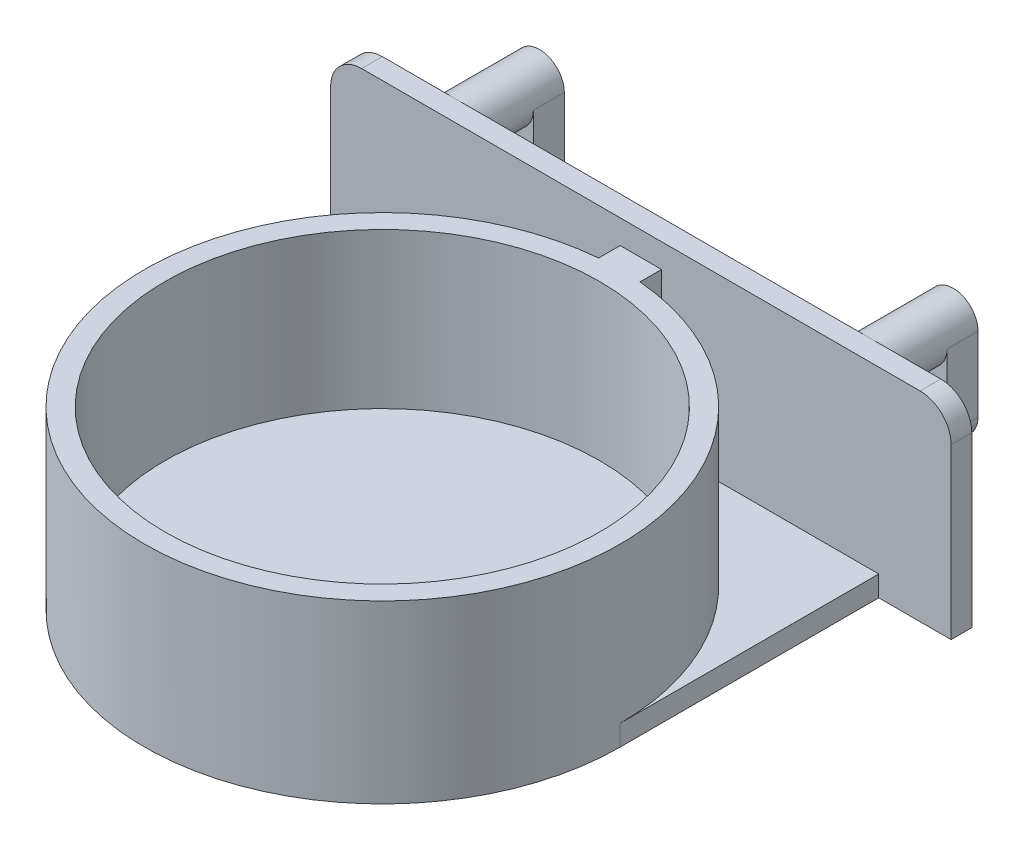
ISO-10303-21;
HEADER;
FILE_DESCRIPTION(('STEP AP214'),'2;1');
FILE_NAME('part.step','',(''),(''),'','','');
FILE_SCHEMA(('AUTOMOTIVE_DESIGN { 1 0 10303 214 1 1 1 1 }'));
ENDSEC;
DATA;
#1=APPLICATION_CONTEXT('core data for automotive mechanical design processes');
#2=APPLICATION_PROTOCOL_DEFINITION('international standard','automotive_design',2000,#1);
#3=PRODUCT_CONTEXT('',#1,'mechanical');
#4=PRODUCT('Part','Part','',(#3));
#5=PRODUCT_RELATED_PRODUCT_CATEGORY('part','',(#4));
#6=PRODUCT_DEFINITION_FORMATION('','',#4);
#7=PRODUCT_DEFINITION_CONTEXT('part definition',#1,'design');
#8=PRODUCT_DEFINITION('design','',#6,#7);
#9=PRODUCT_DEFINITION_SHAPE('','',#8);
#10=(LENGTH_UNIT() NAMED_UNIT(*) SI_UNIT(.MILLI.,.METRE.));
#11=(NAMED_UNIT(*) PLANE_ANGLE_UNIT() SI_UNIT($,.RADIAN.));
#12=(NAMED_UNIT(*) SI_UNIT($,.STERADIAN.) SOLID_ANGLE_UNIT());
#13=UNCERTAINTY_MEASURE_WITH_UNIT(LENGTH_MEASURE(1.E-05),#10,'distance_accuracy_value','');
#14=(GEOMETRIC_REPRESENTATION_CONTEXT(3) GLOBAL_UNCERTAINTY_ASSIGNED_CONTEXT((#13)) GLOBAL_UNIT_ASSIGNED_CONTEXT((#10,
#11,#12)) REPRESENTATION_CONTEXT('',''));
#15=CARTESIAN_POINT('',(0.,0.,0.));
#16=DIRECTION('',(0.,0.,1.));
#17=DIRECTION('',(1.,0.,0.));
#18=AXIS2_PLACEMENT_3D('',#15,#16,#17);
#19=CARTESIAN_POINT('',(0.,0.,0.));
#20=DIRECTION('',(0.,-1.,0.));
#21=DIRECTION('',(0.,0.,-1.));
#22=AXIS2_PLACEMENT_3D('',#19,#20,#21);
#23=PLANE('',#22);
#24=CARTESIAN_POINT('',(0.,0.,0.));
#25=DIRECTION('',(0.,1.,0.));
#26=DIRECTION('',(0.,0.,1.));
#27=AXIS2_PLACEMENT_3D('',#24,#25,#26);
#28=CIRCLE('',#27,23.);
#29=CARTESIAN_POINT('',(-2.,0.,-22.9128784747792));
#30=VERTEX_POINT('',#29);
#31=CARTESIAN_POINT('',(-23.,0.,0.));
#32=VERTEX_POINT('',#31);
#33=EDGE_CURVE('E359',#30,#32,#28,.T.);
#34=ORIENTED_EDGE('',*,*,#33,.F.);
#35=DIRECTION('',(0.,0.,1.));
#36=VECTOR('',#35,1.);
#37=CARTESIAN_POINT('',(-2.,0.,-21.8));
#38=LINE('',#37,#36);
#39=CARTESIAN_POINT('',(-2.,0.,-25.));
#40=VERTEX_POINT('',#39);
#41=EDGE_CURVE('E267',#40,#30,#38,.T.);
#42=ORIENTED_EDGE('',*,*,#41,.F.);
#43=DIRECTION('',(1.,0.,0.));
#44=VECTOR('',#43,1.);
#45=CARTESIAN_POINT('',(23.,0.,-25.));
#46=LINE('',#45,#44);
#47=CARTESIAN_POINT('',(-23.,0.,-25.));
#48=VERTEX_POINT('',#47);
#49=EDGE_CURVE('E340',#48,#40,#46,.T.);
#50=ORIENTED_EDGE('',*,*,#49,.F.);
#51=DIRECTION('',(0.,0.,-1.));
#52=VECTOR('',#51,1.);
#53=CARTESIAN_POINT('',(-23.,0.,0.));
#54=LINE('',#53,#52);
#55=EDGE_CURVE('E327',#32,#48,#54,.T.);
#56=ORIENTED_EDGE('',*,*,#55,.F.);
#57=EDGE_LOOP('',(#34,#42,#50,#56));
#58=FACE_BOUND('',#57,.T.);
#59=ADVANCED_FACE('F33',(#58),#23,.F.);
#60=CARTESIAN_POINT('',(0.,15.,0.));
#61=DIRECTION('',(0.,1.,0.));
#62=DIRECTION('',(0.,0.,1.));
#63=AXIS2_PLACEMENT_3D('',#60,#61,#62);
#64=PLANE('',#63);
#65=DIRECTION('',(0.,0.,1.));
#66=VECTOR('',#65,1.);
#67=CARTESIAN_POINT('',(-2.,15.,-21.8));
#68=LINE('',#67,#66);
#69=CARTESIAN_POINT('',(-2.,15.,-25.));
#70=VERTEX_POINT('',#69);
#71=CARTESIAN_POINT('',(-2.,15.,-22.9128784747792));
#72=VERTEX_POINT('',#71);
#73=EDGE_CURVE('E261',#70,#72,#68,.T.);
#74=ORIENTED_EDGE('',*,*,#73,.T.);
#75=CARTESIAN_POINT('',(0.,15.,0.));
#76=DIRECTION('',(0.,1.,0.));
#77=DIRECTION('',(0.,0.,1.));
#78=AXIS2_PLACEMENT_3D('',#75,#76,#77);
#79=CIRCLE('',#78,23.);
#80=CARTESIAN_POINT('',(2.,15.,-22.9128784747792));
#81=VERTEX_POINT('',#80);
#82=EDGE_CURVE('E362',#72,#81,#79,.T.);
#83=ORIENTED_EDGE('',*,*,#82,.T.);
#84=DIRECTION('',(0.,0.,-1.));
#85=VECTOR('',#84,1.);
#86=CARTESIAN_POINT('',(2.,15.,-21.8));
#87=LINE('',#86,#85);
#88=CARTESIAN_POINT('',(2.,15.,-25.));
#89=VERTEX_POINT('',#88);
#90=EDGE_CURVE('E264',#81,#89,#87,.T.);
#91=ORIENTED_EDGE('',*,*,#90,.T.);
#92=DIRECTION('',(1.,0.,0.));
#93=VECTOR('',#92,1.);
#94=CARTESIAN_POINT('',(-27.,15.,-25.));
#95=LINE('',#94,#93);
#96=EDGE_CURVE('E41',#70,#89,#95,.T.);
#97=ORIENTED_EDGE('',*,*,#96,.F.);
#98=EDGE_LOOP('',(#74,#83,#91,#97));
#99=FACE_BOUND('',#98,.T.);
#100=CARTESIAN_POINT('',(0.,15.,0.));
#101=DIRECTION('',(0.,1.,0.));
#102=DIRECTION('',(0.,0.,1.));
#103=AXIS2_PLACEMENT_3D('',#100,#101,#102);
#104=CIRCLE('',#103,21.);
#105=CARTESIAN_POINT('',(0.,15.,21.));
#106=VERTEX_POINT('',#105);
#107=EDGE_CURVE('E356',#106,#106,#104,.T.);
#108=ORIENTED_EDGE('',*,*,#107,.F.);
#109=EDGE_LOOP('',(#108));
#110=FACE_BOUND('',#109,.T.);
#111=ADVANCED_FACE('F376',(#99,#110),#64,.T.);
#112=CARTESIAN_POINT('',(0.,15.,0.));
#113=DIRECTION('',(0.,-1.,0.));
#114=DIRECTION('',(0.,0.,-1.));
#115=AXIS2_PLACEMENT_3D('',#112,#113,#114);
#116=CYLINDRICAL_SURFACE('',#115,23.);
#117=ORIENTED_EDGE('',*,*,#82,.F.);
#118=DIRECTION('',(0.,-1.,0.));
#119=VECTOR('',#118,1.);
#120=CARTESIAN_POINT('',(-2.,15.,-22.9128784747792));
#121=LINE('',#120,#119);
#122=EDGE_CURVE('E276',#72,#30,#121,.T.);
#123=ORIENTED_EDGE('',*,*,#122,.T.);
#124=ORIENTED_EDGE('',*,*,#33,.T.);
#125=DIRECTION('',(0.,1.,0.));
#126=VECTOR('',#125,1.);
#127=CARTESIAN_POINT('',(-23.,-2.,0.));
#128=LINE('',#127,#126);
#129=CARTESIAN_POINT('',(-23.,-2.,0.));
#130=VERTEX_POINT('',#129);
#131=EDGE_CURVE('E352',#130,#32,#128,.T.);
#132=ORIENTED_EDGE('',*,*,#131,.F.);
#133=CARTESIAN_POINT('',(0.,-2.,0.));
#134=DIRECTION('',(0.,-1.,0.));
#135=DIRECTION('',(0.,0.,-1.));
#136=AXIS2_PLACEMENT_3D('',#133,#134,#135);
#137=CIRCLE('',#136,23.);
#138=CARTESIAN_POINT('',(23.,-2.,0.));
#139=VERTEX_POINT('',#138);
#140=EDGE_CURVE('E328',#139,#130,#137,.T.);
#141=ORIENTED_EDGE('',*,*,#140,.F.);
#142=DIRECTION('',(0.,1.,0.));
#143=VECTOR('',#142,1.);
#144=CARTESIAN_POINT('',(23.,-2.,0.));
#145=LINE('',#144,#143);
#146=CARTESIAN_POINT('',(23.,0.,0.));
#147=VERTEX_POINT('',#146);
#148=EDGE_CURVE('E336',#139,#147,#145,.T.);
#149=ORIENTED_EDGE('',*,*,#148,.T.);
#150=CARTESIAN_POINT('',(2.,0.,-22.9128784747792));
#151=VERTEX_POINT('',#150);
#152=EDGE_CURVE('E366',#147,#151,#28,.T.);
#153=ORIENTED_EDGE('',*,*,#152,.T.);
#154=DIRECTION('',(0.,-1.,0.));
#155=VECTOR('',#154,1.);
#156=CARTESIAN_POINT('',(2.,15.,-22.9128784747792));
#157=LINE('',#156,#155);
#158=EDGE_CURVE('E273',#151,#81,#157,.F.);
#159=ORIENTED_EDGE('',*,*,#158,.T.);
#160=EDGE_LOOP('',(#117,#123,#124,#132,#141,#149,#153,#159));
#161=FACE_BOUND('',#160,.T.);
#162=ADVANCED_FACE('F35',(#161),#116,.T.);
#163=CARTESIAN_POINT('',(0.,15.,0.));
#164=DIRECTION('',(0.,-1.,0.));
#165=DIRECTION('',(0.,0.,-1.));
#166=AXIS2_PLACEMENT_3D('',#163,#164,#165);
#167=CYLINDRICAL_SURFACE('',#166,21.);
#168=ORIENTED_EDGE('',*,*,#107,.T.);
#169=EDGE_LOOP('',(#168));
#170=FACE_BOUND('',#169,.T.);
#171=CARTESIAN_POINT('',(0.,0.,0.));
#172=DIRECTION('',(0.,1.,0.));
#173=DIRECTION('',(0.,0.,1.));
#174=AXIS2_PLACEMENT_3D('',#171,#172,#173);
#175=CIRCLE('',#174,21.);
#176=CARTESIAN_POINT('',(0.,0.,21.));
#177=VERTEX_POINT('',#176);
#178=EDGE_CURVE('E355',#177,#177,#175,.T.);
#179=ORIENTED_EDGE('',*,*,#178,.F.);
#180=EDGE_LOOP('',(#179));
#181=FACE_BOUND('',#180,.T.);
#182=ADVANCED_FACE('F424',(#170,#181),#167,.F.);
#183=ORIENTED_EDGE('',*,*,#178,.T.);
#184=EDGE_LOOP('',(#183));
#185=FACE_BOUND('',#184,.T.);
#186=ADVANCED_FACE('F417',(#185),#23,.F.);
#187=CARTESIAN_POINT('',(-23.,-2.,0.));
#188=DIRECTION('',(1.,0.,0.));
#189=DIRECTION('',(0.,0.,-1.));
#190=AXIS2_PLACEMENT_3D('',#187,#188,#189);
#191=PLANE('',#190);
#192=ORIENTED_EDGE('',*,*,#55,.T.);
#193=DIRECTION('',(0.,1.,0.));
#194=VECTOR('',#193,1.);
#195=CARTESIAN_POINT('',(-23.,-2.,-25.));
#196=LINE('',#195,#194);
#197=CARTESIAN_POINT('',(-23.,-2.,-25.));
#198=VERTEX_POINT('',#197);
#199=EDGE_CURVE('E349',#198,#48,#196,.T.);
#200=ORIENTED_EDGE('',*,*,#199,.F.);
#201=DIRECTION('',(0.,0.,-1.));
#202=VECTOR('',#201,1.);
#203=CARTESIAN_POINT('',(-23.,-2.,0.));
#204=LINE('',#203,#202);
#205=EDGE_CURVE('E331',#130,#198,#204,.T.);
#206=ORIENTED_EDGE('',*,*,#205,.F.);
#207=ORIENTED_EDGE('',*,*,#131,.T.);
#208=EDGE_LOOP('',(#192,#200,#206,#207));
#209=FACE_BOUND('',#208,.T.);
#210=ADVANCED_FACE('F389',(#209),#191,.F.);
#211=CARTESIAN_POINT('',(23.,-2.,0.));
#212=DIRECTION('',(-1.,0.,0.));
#213=DIRECTION('',(0.,0.,1.));
#214=AXIS2_PLACEMENT_3D('',#211,#212,#213);
#215=PLANE('',#214);
#216=DIRECTION('',(0.,0.,1.));
#217=VECTOR('',#216,1.);
#218=CARTESIAN_POINT('',(23.,0.,0.));
#219=LINE('',#218,#217);
#220=CARTESIAN_POINT('',(23.,0.,-25.));
#221=VERTEX_POINT('',#220);
#222=EDGE_CURVE('E332',#221,#147,#219,.T.);
#223=ORIENTED_EDGE('',*,*,#222,.T.);
#224=ORIENTED_EDGE('',*,*,#148,.F.);
#225=DIRECTION('',(0.,0.,1.));
#226=VECTOR('',#225,1.);
#227=CARTESIAN_POINT('',(23.,-2.,0.));
#228=LINE('',#227,#226);
#229=CARTESIAN_POINT('',(23.,-2.,-25.));
#230=VERTEX_POINT('',#229);
#231=EDGE_CURVE('E334',#230,#139,#228,.T.);
#232=ORIENTED_EDGE('',*,*,#231,.F.);
#233=DIRECTION('',(0.,1.,0.));
#234=VECTOR('',#233,1.);
#235=CARTESIAN_POINT('',(23.,-2.,-25.));
#236=LINE('',#235,#234);
#237=EDGE_CURVE('E346',#230,#221,#236,.T.);
#238=ORIENTED_EDGE('',*,*,#237,.T.);
#239=EDGE_LOOP('',(#223,#224,#232,#238));
#240=FACE_BOUND('',#239,.T.);
#241=ADVANCED_FACE('F397',(#240),#215,.F.);
#242=CARTESIAN_POINT('',(0.,-2.,0.));
#243=DIRECTION('',(0.,-1.,0.));
#244=DIRECTION('',(0.,0.,-1.));
#245=AXIS2_PLACEMENT_3D('',#242,#243,#244);
#246=PLANE('',#245);
#247=ORIENTED_EDGE('',*,*,#140,.T.);
#248=ORIENTED_EDGE('',*,*,#205,.T.);
#249=DIRECTION('',(-1.,0.,0.));
#250=VECTOR('',#249,1.);
#251=CARTESIAN_POINT('',(30.,-1.99999999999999,-25.));
#252=LINE('',#251,#250);
#253=CARTESIAN_POINT('',(-30.,-1.99999999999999,-25.));
#254=VERTEX_POINT('',#253);
#255=EDGE_CURVE('E305',#198,#254,#252,.T.);
#256=ORIENTED_EDGE('',*,*,#255,.T.);
#257=DIRECTION('',(0.,0.,1.));
#258=VECTOR('',#257,1.);
#259=CARTESIAN_POINT('',(-30.,-1.99999999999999,-27.));
#260=LINE('',#259,#258);
#261=CARTESIAN_POINT('',(-30.,-1.99999999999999,-27.));
#262=VERTEX_POINT('',#261);
#263=EDGE_CURVE('E312',#262,#254,#260,.T.);
#264=ORIENTED_EDGE('',*,*,#263,.F.);
#265=DIRECTION('',(-1.,0.,0.));
#266=VECTOR('',#265,1.);
#267=CARTESIAN_POINT('',(30.,-1.99999999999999,-27.));
#268=LINE('',#267,#266);
#269=CARTESIAN_POINT('',(30.,-1.99999999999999,-27.));
#270=VERTEX_POINT('',#269);
#271=EDGE_CURVE('E292',#270,#262,#268,.T.);
#272=ORIENTED_EDGE('',*,*,#271,.F.);
#273=DIRECTION('',(0.,0.,1.));
#274=VECTOR('',#273,1.);
#275=CARTESIAN_POINT('',(30.,-1.99999999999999,-27.));
#276=LINE('',#275,#274);
#277=CARTESIAN_POINT('',(30.,-1.99999999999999,-25.));
#278=VERTEX_POINT('',#277);
#279=EDGE_CURVE('E315',#270,#278,#276,.T.);
#280=ORIENTED_EDGE('',*,*,#279,.T.);
#281=EDGE_CURVE('E306',#278,#230,#252,.T.);
#282=ORIENTED_EDGE('',*,*,#281,.T.);
#283=ORIENTED_EDGE('',*,*,#231,.T.);
#284=EDGE_LOOP('',(#247,#248,#256,#264,#272,#280,#282,#283));
#285=FACE_BOUND('',#284,.T.);
#286=ADVANCED_FACE('F393',(#285),#246,.T.);
#287=CARTESIAN_POINT('',(2.,0.,-25.));
#288=VERTEX_POINT('',#287);
#289=EDGE_CURVE('E339',#288,#221,#46,.T.);
#290=ORIENTED_EDGE('',*,*,#289,.F.);
#291=DIRECTION('',(0.,0.,-1.));
#292=VECTOR('',#291,1.);
#293=CARTESIAN_POINT('',(2.,0.,-21.8));
#294=LINE('',#293,#292);
#295=EDGE_CURVE('E271',#151,#288,#294,.T.);
#296=ORIENTED_EDGE('',*,*,#295,.F.);
#297=ORIENTED_EDGE('',*,*,#152,.F.);
#298=ORIENTED_EDGE('',*,*,#222,.F.);
#299=EDGE_LOOP('',(#290,#296,#297,#298));
#300=FACE_BOUND('',#299,.T.);
#301=ADVANCED_FACE('F402',(#300),#23,.F.);
#302=CARTESIAN_POINT('',(-27.,14.3250882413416,-27.));
#303=DIRECTION('',(0.,0.,1.));
#304=DIRECTION('',(1.,0.,0.));
#305=AXIS2_PLACEMENT_3D('',#302,#303,#304);
#306=CYLINDRICAL_SURFACE('',#305,3.);
#307=CARTESIAN_POINT('',(-27.,14.3250882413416,-25.));
#308=DIRECTION('',(0.,0.,-1.));
#309=DIRECTION('',(-1.,0.,0.));
#310=AXIS2_PLACEMENT_3D('',#307,#308,#309);
#311=CIRCLE('',#310,3.);
#312=CARTESIAN_POINT('',(-30.,14.3250882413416,-25.));
#313=VERTEX_POINT('',#312);
#314=CARTESIAN_POINT('',(-27.,17.3250882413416,-25.));
#315=VERTEX_POINT('',#314);
#316=EDGE_CURVE('E279',#313,#315,#311,.T.);
#317=ORIENTED_EDGE('',*,*,#316,.T.);
#318=DIRECTION('',(0.,0.,1.));
#319=VECTOR('',#318,1.);
#320=CARTESIAN_POINT('',(-27.,17.3250882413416,-27.));
#321=LINE('',#320,#319);
#322=CARTESIAN_POINT('',(-27.,17.3250882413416,-27.));
#323=VERTEX_POINT('',#322);
#324=EDGE_CURVE('E324',#323,#315,#321,.T.);
#325=ORIENTED_EDGE('',*,*,#324,.F.);
#326=CARTESIAN_POINT('',(-27.,14.3250882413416,-27.));
#327=DIRECTION('',(0.,0.,-1.));
#328=DIRECTION('',(-1.,0.,0.));
#329=AXIS2_PLACEMENT_3D('',#326,#327,#328);
#330=CIRCLE('',#329,3.);
#331=CARTESIAN_POINT('',(-30.,14.3250882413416,-27.));
#332=VERTEX_POINT('',#331);
#333=EDGE_CURVE('E280',#332,#323,#330,.T.);
#334=ORIENTED_EDGE('',*,*,#333,.F.);
#335=DIRECTION('',(0.,0.,1.));
#336=VECTOR('',#335,1.);
#337=CARTESIAN_POINT('',(-30.,14.3250882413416,-27.));
#338=LINE('',#337,#336);
#339=EDGE_CURVE('E296',#332,#313,#338,.T.);
#340=ORIENTED_EDGE('',*,*,#339,.T.);
#341=EDGE_LOOP('',(#317,#325,#334,#340));
#342=FACE_BOUND('',#341,.T.);
#343=ADVANCED_FACE('F427',(#342),#306,.T.);
#344=CARTESIAN_POINT('',(-27.,17.3250882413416,-27.));
#345=DIRECTION('',(0.,-1.,0.));
#346=DIRECTION('',(1.,0.,0.));
#347=AXIS2_PLACEMENT_3D('',#344,#345,#346);
#348=PLANE('',#347);
#349=DIRECTION('',(1.,0.,0.));
#350=VECTOR('',#349,1.);
#351=CARTESIAN_POINT('',(-27.,17.3250882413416,-25.));
#352=LINE('',#351,#350);
#353=CARTESIAN_POINT('',(27.,17.3250882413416,-25.));
#354=VERTEX_POINT('',#353);
#355=EDGE_CURVE('E299',#315,#354,#352,.T.);
#356=ORIENTED_EDGE('',*,*,#355,.T.);
#357=DIRECTION('',(0.,0.,1.));
#358=VECTOR('',#357,1.);
#359=CARTESIAN_POINT('',(27.,17.3250882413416,-27.));
#360=LINE('',#359,#358);
#361=CARTESIAN_POINT('',(27.,17.3250882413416,-27.));
#362=VERTEX_POINT('',#361);
#363=EDGE_CURVE('E321',#362,#354,#360,.T.);
#364=ORIENTED_EDGE('',*,*,#363,.F.);
#365=DIRECTION('',(1.,0.,0.));
#366=VECTOR('',#365,1.);
#367=CARTESIAN_POINT('',(-27.,17.3250882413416,-27.));
#368=LINE('',#367,#366);
#369=CARTESIAN_POINT('',(20.,17.3250882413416,-27.));
#370=VERTEX_POINT('',#369);
#371=EDGE_CURVE('E283',#370,#362,#368,.T.);
#372=ORIENTED_EDGE('',*,*,#371,.F.);
#373=CARTESIAN_POINT('',(-20.,17.3250882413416,-27.));
#374=VERTEX_POINT('',#373);
#375=EDGE_CURVE('E288',#374,#370,#368,.T.);
#376=ORIENTED_EDGE('',*,*,#375,.F.);
#377=EDGE_CURVE('E285',#323,#374,#368,.T.);
#378=ORIENTED_EDGE('',*,*,#377,.F.);
#379=ORIENTED_EDGE('',*,*,#324,.T.);
#380=EDGE_LOOP('',(#356,#364,#372,#376,#378,#379));
#381=FACE_BOUND('',#380,.T.);
#382=ADVANCED_FACE('F432',(#381),#348,.F.);
#383=CARTESIAN_POINT('',(27.,14.3250882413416,-27.));
#384=DIRECTION('',(0.,0.,1.));
#385=DIRECTION('',(1.,0.,0.));
#386=AXIS2_PLACEMENT_3D('',#383,#384,#385);
#387=CYLINDRICAL_SURFACE('',#386,3.);
#388=CARTESIAN_POINT('',(27.,14.3250882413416,-25.));
#389=DIRECTION('',(0.,0.,-1.));
#390=DIRECTION('',(-1.,0.,0.));
#391=AXIS2_PLACEMENT_3D('',#388,#389,#390);
#392=CIRCLE('',#391,3.);
#393=CARTESIAN_POINT('',(30.,14.3250882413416,-25.));
#394=VERTEX_POINT('',#393);
#395=EDGE_CURVE('E301',#354,#394,#392,.T.);
#396=ORIENTED_EDGE('',*,*,#395,.T.);
#397=DIRECTION('',(0.,0.,1.));
#398=VECTOR('',#397,1.);
#399=CARTESIAN_POINT('',(30.,14.3250882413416,-27.));
#400=LINE('',#399,#398);
#401=CARTESIAN_POINT('',(30.,14.3250882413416,-27.));
#402=VERTEX_POINT('',#401);
#403=EDGE_CURVE('E318',#402,#394,#400,.T.);
#404=ORIENTED_EDGE('',*,*,#403,.F.);
#405=CARTESIAN_POINT('',(27.,14.3250882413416,-27.));
#406=DIRECTION('',(0.,0.,-1.));
#407=DIRECTION('',(-1.,0.,0.));
#408=AXIS2_PLACEMENT_3D('',#405,#406,#407);
#409=CIRCLE('',#408,3.);
#410=EDGE_CURVE('E287',#362,#402,#409,.T.);
#411=ORIENTED_EDGE('',*,*,#410,.F.);
#412=ORIENTED_EDGE('',*,*,#363,.T.);
#413=EDGE_LOOP('',(#396,#404,#411,#412));
#414=FACE_BOUND('',#413,.T.);
#415=ADVANCED_FACE('F441',(#414),#387,.T.);
#416=CARTESIAN_POINT('',(30.,-1.99999999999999,-27.));
#417=DIRECTION('',(-1.,0.,0.));
#418=DIRECTION('',(0.,0.,1.));
#419=AXIS2_PLACEMENT_3D('',#416,#417,#418);
#420=PLANE('',#419);
#421=DIRECTION('',(0.,-1.,0.));
#422=VECTOR('',#421,1.);
#423=CARTESIAN_POINT('',(30.,-1.99999999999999,-25.));
#424=LINE('',#423,#422);
#425=EDGE_CURVE('E303',#394,#278,#424,.T.);
#426=ORIENTED_EDGE('',*,*,#425,.T.);
#427=ORIENTED_EDGE('',*,*,#279,.F.);
#428=DIRECTION('',(0.,-1.,0.));
#429=VECTOR('',#428,1.);
#430=CARTESIAN_POINT('',(30.,-1.99999999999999,-27.));
#431=LINE('',#430,#429);
#432=EDGE_CURVE('E290',#402,#270,#431,.T.);
#433=ORIENTED_EDGE('',*,*,#432,.F.);
#434=ORIENTED_EDGE('',*,*,#403,.T.);
#435=EDGE_LOOP('',(#426,#427,#433,#434));
#436=FACE_BOUND('',#435,.T.);
#437=ADVANCED_FACE('F445',(#436),#420,.F.);
#438=CARTESIAN_POINT('',(-30.,-1.99999999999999,-27.));
#439=DIRECTION('',(1.,0.,0.));
#440=DIRECTION('',(0.,0.,-1.));
#441=AXIS2_PLACEMENT_3D('',#438,#439,#440);
#442=PLANE('',#441);
#443=DIRECTION('',(0.,1.,0.));
#444=VECTOR('',#443,1.);
#445=CARTESIAN_POINT('',(-30.,-1.99999999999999,-25.));
#446=LINE('',#445,#444);
#447=EDGE_CURVE('E284',#254,#313,#446,.T.);
#448=ORIENTED_EDGE('',*,*,#447,.T.);
#449=ORIENTED_EDGE('',*,*,#339,.F.);
#450=DIRECTION('',(0.,1.,0.));
#451=VECTOR('',#450,1.);
#452=CARTESIAN_POINT('',(-30.,-1.99999999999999,-27.));
#453=LINE('',#452,#451);
#454=EDGE_CURVE('E294',#262,#332,#453,.T.);
#455=ORIENTED_EDGE('',*,*,#454,.F.);
#456=ORIENTED_EDGE('',*,*,#263,.T.);
#457=EDGE_LOOP('',(#448,#449,#455,#456));
#458=FACE_BOUND('',#457,.T.);
#459=ADVANCED_FACE('F449',(#458),#442,.F.);
#460=CARTESIAN_POINT('',(-27.,14.3250882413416,-27.));
#461=DIRECTION('',(0.,0.,-1.));
#462=DIRECTION('',(-1.,0.,0.));
#463=AXIS2_PLACEMENT_3D('',#460,#461,#462);
#464=PLANE('',#463);
#465=ORIENTED_EDGE('',*,*,#377,.T.);
#466=CARTESIAN_POINT('',(-20.,14.9250882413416,-27.));
#467=DIRECTION('',(0.,0.,1.));
#468=DIRECTION('',(1.,0.,0.));
#469=AXIS2_PLACEMENT_3D('',#466,#467,#468);
#470=CIRCLE('',#469,2.4);
#471=EDGE_CURVE('E200',#374,#374,#470,.T.);
#472=ORIENTED_EDGE('',*,*,#471,.T.);
#473=ORIENTED_EDGE('',*,*,#375,.T.);
#474=CARTESIAN_POINT('',(20.,14.9250882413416,-27.));
#475=DIRECTION('',(0.,0.,-1.));
#476=DIRECTION('',(-1.,0.,0.));
#477=AXIS2_PLACEMENT_3D('',#474,#475,#476);
#478=CIRCLE('',#477,2.4);
#479=EDGE_CURVE('E259',#370,#370,#478,.T.);
#480=ORIENTED_EDGE('',*,*,#479,.F.);
#481=ORIENTED_EDGE('',*,*,#371,.T.);
#482=ORIENTED_EDGE('',*,*,#410,.T.);
#483=ORIENTED_EDGE('',*,*,#432,.T.);
#484=ORIENTED_EDGE('',*,*,#271,.T.);
#485=ORIENTED_EDGE('',*,*,#454,.T.);
#486=ORIENTED_EDGE('',*,*,#333,.T.);
#487=EDGE_LOOP('',(#465,#472,#473,#480,#481,#482,#483,#484,#485,#486));
#488=FACE_BOUND('',#487,.T.);
#489=ADVANCED_FACE('F453',(#488),#464,.T.);
#490=CARTESIAN_POINT('',(-27.,14.3250882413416,-25.));
#491=DIRECTION('',(0.,0.,-1.));
#492=DIRECTION('',(-1.,0.,0.));
#493=AXIS2_PLACEMENT_3D('',#490,#491,#492);
#494=PLANE('',#493);
#495=ORIENTED_EDGE('',*,*,#49,.T.);
#496=DIRECTION('',(0.,1.,0.));
#497=VECTOR('',#496,1.);
#498=CARTESIAN_POINT('',(-2.,14.3250882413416,-25.));
#499=LINE('',#498,#497);
#500=EDGE_CURVE('E11',#40,#70,#499,.T.);
#501=ORIENTED_EDGE('',*,*,#500,.T.);
#502=ORIENTED_EDGE('',*,*,#96,.T.);
#503=DIRECTION('',(0.,-1.,0.));
#504=VECTOR('',#503,1.);
#505=CARTESIAN_POINT('',(2.,14.3250882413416,-25.));
#506=LINE('',#505,#504);
#507=EDGE_CURVE('E365',#89,#288,#506,.T.);
#508=ORIENTED_EDGE('',*,*,#507,.T.);
#509=ORIENTED_EDGE('',*,*,#289,.T.);
#510=ORIENTED_EDGE('',*,*,#237,.F.);
#511=ORIENTED_EDGE('',*,*,#281,.F.);
#512=ORIENTED_EDGE('',*,*,#425,.F.);
#513=ORIENTED_EDGE('',*,*,#395,.F.);
#514=ORIENTED_EDGE('',*,*,#355,.F.);
#515=ORIENTED_EDGE('',*,*,#316,.F.);
#516=ORIENTED_EDGE('',*,*,#447,.F.);
#517=ORIENTED_EDGE('',*,*,#255,.F.);
#518=ORIENTED_EDGE('',*,*,#199,.T.);
#519=EDGE_LOOP('',(#495,#501,#502,#508,#509,#510,#511,#512,#513,#514,#515,#516,#517,#518));
#520=FACE_BOUND('',#519,.T.);
#521=ADVANCED_FACE('F372',(#520),#494,.F.);
#522=CARTESIAN_POINT('',(-2.,-6.40312423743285,-21.8));
#523=DIRECTION('',(-1.,0.,0.));
#524=DIRECTION('',(0.,0.,1.));
#525=AXIS2_PLACEMENT_3D('',#522,#523,#524);
#526=PLANE('',#525);
#527=ORIENTED_EDGE('',*,*,#122,.F.);
#528=ORIENTED_EDGE('',*,*,#73,.F.);
#529=ORIENTED_EDGE('',*,*,#500,.F.);
#530=ORIENTED_EDGE('',*,*,#41,.T.);
#531=EDGE_LOOP('',(#527,#528,#529,#530));
#532=FACE_BOUND('',#531,.T.);
#533=ADVANCED_FACE('F380',(#532),#526,.T.);
#534=CARTESIAN_POINT('',(2.,-6.40312423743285,-21.8));
#535=DIRECTION('',(1.,0.,0.));
#536=DIRECTION('',(0.,0.,-1.));
#537=AXIS2_PLACEMENT_3D('',#534,#535,#536);
#538=PLANE('',#537);
#539=ORIENTED_EDGE('',*,*,#158,.F.);
#540=ORIENTED_EDGE('',*,*,#295,.T.);
#541=ORIENTED_EDGE('',*,*,#507,.F.);
#542=ORIENTED_EDGE('',*,*,#90,.F.);
#543=EDGE_LOOP('',(#539,#540,#541,#542));
#544=FACE_BOUND('',#543,.T.);
#545=ADVANCED_FACE('F404',(#544),#538,.T.);
#546=CARTESIAN_POINT('',(20.,14.9250882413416,-32.2));
#547=DIRECTION('',(0.,0.,1.));
#548=DIRECTION('',(1.,0.,0.));
#549=AXIS2_PLACEMENT_3D('',#546,#547,#548);
#550=CYLINDRICAL_SURFACE('',#549,2.4);
#551=CARTESIAN_POINT('',(20.,14.9250882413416,-32.2));
#552=DIRECTION('',(0.,0.,-1.));
#553=DIRECTION('',(-1.,0.,0.));
#554=AXIS2_PLACEMENT_3D('',#551,#552,#553);
#555=CIRCLE('',#554,2.4);
#556=CARTESIAN_POINT('',(22.4,14.9250882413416,-32.2));
#557=VERTEX_POINT('',#556);
#558=CARTESIAN_POINT('',(17.6,14.9250882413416,-32.2));
#559=VERTEX_POINT('',#558);
#560=EDGE_CURVE('E56',#557,#559,#555,.T.);
#561=ORIENTED_EDGE('',*,*,#560,.F.);
#562=DIRECTION('',(0.,0.,1.));
#563=VECTOR('',#562,1.);
#564=CARTESIAN_POINT('',(22.4,14.9250882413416,-35.2));
#565=LINE('',#564,#563);
#566=CARTESIAN_POINT('',(22.4,14.9250882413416,-35.2));
#567=VERTEX_POINT('',#566);
#568=EDGE_CURVE('E256',#567,#557,#565,.T.);
#569=ORIENTED_EDGE('',*,*,#568,.F.);
#570=CARTESIAN_POINT('',(20.,14.9250882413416,-35.2));
#571=DIRECTION('',(0.,0.,-1.));
#572=DIRECTION('',(-1.,0.,0.));
#573=AXIS2_PLACEMENT_3D('',#570,#571,#572);
#574=CIRCLE('',#573,2.4);
#575=CARTESIAN_POINT('',(17.6,14.9250882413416,-35.2));
#576=VERTEX_POINT('',#575);
#577=EDGE_CURVE('E233',#576,#567,#574,.T.);
#578=ORIENTED_EDGE('',*,*,#577,.F.);
#579=DIRECTION('',(0.,0.,1.));
#580=VECTOR('',#579,1.);
#581=CARTESIAN_POINT('',(17.6,14.9250882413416,-35.2));
#582=LINE('',#581,#580);
#583=EDGE_CURVE('E243',#576,#559,#582,.T.);
#584=ORIENTED_EDGE('',*,*,#583,.T.);
#585=EDGE_LOOP('',(#561,#569,#578,#584));
#586=FACE_BOUND('',#585,.T.);
#587=ORIENTED_EDGE('',*,*,#479,.T.);
#588=EDGE_LOOP('',(#587));
#589=FACE_BOUND('',#588,.T.);
#590=ADVANCED_FACE('F406',(#586,#589),#550,.T.);
#591=CARTESIAN_POINT('',(20.,14.9250882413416,-32.2));
#592=DIRECTION('',(0.,0.,-1.));
#593=DIRECTION('',(-1.,0.,0.));
#594=AXIS2_PLACEMENT_3D('',#591,#592,#593);
#595=PLANE('',#594);
#596=DIRECTION('',(0.,-1.,0.));
#597=VECTOR('',#596,1.);
#598=CARTESIAN_POINT('',(22.4,14.9250882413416,-32.2));
#599=LINE('',#598,#597);
#600=CARTESIAN_POINT('',(22.4,7.72508824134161,-32.2));
#601=VERTEX_POINT('',#600);
#602=EDGE_CURVE('E230',#557,#601,#599,.T.);
#603=ORIENTED_EDGE('',*,*,#602,.F.);
#604=ORIENTED_EDGE('',*,*,#560,.T.);
#605=DIRECTION('',(0.,1.,0.));
#606=VECTOR('',#605,1.);
#607=CARTESIAN_POINT('',(17.6,14.9250882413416,-32.2));
#608=LINE('',#607,#606);
#609=CARTESIAN_POINT('',(17.6,7.72508824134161,-32.2));
#610=VERTEX_POINT('',#609);
#611=EDGE_CURVE('E237',#610,#559,#608,.T.);
#612=ORIENTED_EDGE('',*,*,#611,.F.);
#613=CARTESIAN_POINT('',(20.,7.72508824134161,-32.2));
#614=DIRECTION('',(0.,0.,-1.));
#615=DIRECTION('',(-1.,0.,0.));
#616=AXIS2_PLACEMENT_3D('',#613,#614,#615);
#617=CIRCLE('',#616,2.39999999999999);
#618=EDGE_CURVE('E245',#601,#610,#617,.T.);
#619=ORIENTED_EDGE('',*,*,#618,.F.);
#620=EDGE_LOOP('',(#603,#604,#612,#619));
#621=FACE_BOUND('',#620,.T.);
#622=ADVANCED_FACE('F412',(#621),#595,.F.);
#623=CARTESIAN_POINT('',(22.4,14.9250882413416,-35.2));
#624=DIRECTION('',(-1.,0.,0.));
#625=DIRECTION('',(0.,-1.,0.));
#626=AXIS2_PLACEMENT_3D('',#623,#624,#625);
#627=PLANE('',#626);
#628=ORIENTED_EDGE('',*,*,#602,.T.);
#629=DIRECTION('',(0.,0.,1.));
#630=VECTOR('',#629,1.);
#631=CARTESIAN_POINT('',(22.4,7.72508824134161,-35.2));
#632=LINE('',#631,#630);
#633=CARTESIAN_POINT('',(22.4,7.72508824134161,-35.2));
#634=VERTEX_POINT('',#633);
#635=EDGE_CURVE('E253',#634,#601,#632,.T.);
#636=ORIENTED_EDGE('',*,*,#635,.F.);
#637=DIRECTION('',(0.,-1.,0.));
#638=VECTOR('',#637,1.);
#639=CARTESIAN_POINT('',(22.4,14.9250882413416,-35.2));
#640=LINE('',#639,#638);
#641=EDGE_CURVE('E236',#567,#634,#640,.T.);
#642=ORIENTED_EDGE('',*,*,#641,.F.);
#643=ORIENTED_EDGE('',*,*,#568,.T.);
#644=EDGE_LOOP('',(#628,#636,#642,#643));
#645=FACE_BOUND('',#644,.T.);
#646=ADVANCED_FACE('F498',(#645),#627,.F.);
#647=CARTESIAN_POINT('',(20.,7.72508824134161,-35.2));
#648=DIRECTION('',(0.,0.,1.));
#649=DIRECTION('',(1.,0.,0.));
#650=AXIS2_PLACEMENT_3D('',#647,#648,#649);
#651=CYLINDRICAL_SURFACE('',#650,2.39999999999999);
#652=ORIENTED_EDGE('',*,*,#618,.T.);
#653=DIRECTION('',(0.,0.,1.));
#654=VECTOR('',#653,1.);
#655=CARTESIAN_POINT('',(17.6,7.72508824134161,-35.2));
#656=LINE('',#655,#654);
#657=CARTESIAN_POINT('',(17.6,7.72508824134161,-35.2));
#658=VERTEX_POINT('',#657);
#659=EDGE_CURVE('E250',#658,#610,#656,.T.);
#660=ORIENTED_EDGE('',*,*,#659,.F.);
#661=CARTESIAN_POINT('',(20.,7.72508824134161,-35.2));
#662=DIRECTION('',(0.,0.,-1.));
#663=DIRECTION('',(-1.,0.,0.));
#664=AXIS2_PLACEMENT_3D('',#661,#662,#663);
#665=CIRCLE('',#664,2.39999999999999);
#666=EDGE_CURVE('E239',#634,#658,#665,.T.);
#667=ORIENTED_EDGE('',*,*,#666,.F.);
#668=ORIENTED_EDGE('',*,*,#635,.T.);
#669=EDGE_LOOP('',(#652,#660,#667,#668));
#670=FACE_BOUND('',#669,.T.);
#671=ADVANCED_FACE('F502',(#670),#651,.T.);
#672=CARTESIAN_POINT('',(17.6,14.9250882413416,-35.2));
#673=DIRECTION('',(1.,0.,0.));
#674=DIRECTION('',(0.,1.,0.));
#675=AXIS2_PLACEMENT_3D('',#672,#673,#674);
#676=PLANE('',#675);
#677=ORIENTED_EDGE('',*,*,#611,.T.);
#678=ORIENTED_EDGE('',*,*,#583,.F.);
#679=DIRECTION('',(0.,1.,0.));
#680=VECTOR('',#679,1.);
#681=CARTESIAN_POINT('',(17.6,14.9250882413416,-35.2));
#682=LINE('',#681,#680);
#683=EDGE_CURVE('E241',#658,#576,#682,.T.);
#684=ORIENTED_EDGE('',*,*,#683,.F.);
#685=ORIENTED_EDGE('',*,*,#659,.T.);
#686=EDGE_LOOP('',(#677,#678,#684,#685));
#687=FACE_BOUND('',#686,.T.);
#688=ADVANCED_FACE('F491',(#687),#676,.F.);
#689=CARTESIAN_POINT('',(20.,14.9250882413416,-35.2));
#690=DIRECTION('',(0.,0.,-1.));
#691=DIRECTION('',(-1.,0.,0.));
#692=AXIS2_PLACEMENT_3D('',#689,#690,#691);
#693=PLANE('',#692);
#694=ORIENTED_EDGE('',*,*,#577,.T.);
#695=ORIENTED_EDGE('',*,*,#641,.T.);
#696=ORIENTED_EDGE('',*,*,#666,.T.);
#697=ORIENTED_EDGE('',*,*,#683,.T.);
#698=EDGE_LOOP('',(#694,#695,#696,#697));
#699=FACE_BOUND('',#698,.T.);
#700=ADVANCED_FACE('F484',(#699),#693,.T.);
#701=CARTESIAN_POINT('',(-20.,14.9250882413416,-32.2));
#702=DIRECTION('',(0.,0.,1.));
#703=DIRECTION('',(1.,0.,0.));
#704=AXIS2_PLACEMENT_3D('',#701,#702,#703);
#705=CYLINDRICAL_SURFACE('',#704,2.4);
#706=CARTESIAN_POINT('',(-20.,14.9250882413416,-32.2));
#707=DIRECTION('',(0.,0.,1.));
#708=DIRECTION('',(1.,0.,0.));
#709=AXIS2_PLACEMENT_3D('',#706,#707,#708);
#710=CIRCLE('',#709,2.4);
#711=CARTESIAN_POINT('',(-22.4,14.9250882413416,-32.2));
#712=VERTEX_POINT('',#711);
#713=CARTESIAN_POINT('',(-17.6,14.9250882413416,-32.2));
#714=VERTEX_POINT('',#713);
#715=EDGE_CURVE('E197',#712,#714,#710,.T.);
#716=ORIENTED_EDGE('',*,*,#715,.T.);
#717=DIRECTION('',(0.,0.,1.));
#718=VECTOR('',#717,1.);
#719=CARTESIAN_POINT('',(-17.6,14.9250882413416,-35.2));
#720=LINE('',#719,#718);
#721=CARTESIAN_POINT('',(-17.6,14.9250882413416,-35.2));
#722=VERTEX_POINT('',#721);
#723=EDGE_CURVE('E190',#722,#714,#720,.T.);
#724=ORIENTED_EDGE('',*,*,#723,.F.);
#725=CARTESIAN_POINT('',(-20.,14.9250882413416,-35.2));
#726=DIRECTION('',(0.,0.,1.));
#727=DIRECTION('',(1.,0.,0.));
#728=AXIS2_PLACEMENT_3D('',#725,#726,#727);
#729=CIRCLE('',#728,2.4);
#730=CARTESIAN_POINT('',(-22.4,14.9250882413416,-35.2));
#731=VERTEX_POINT('',#730);
#732=EDGE_CURVE('E195',#722,#731,#729,.T.);
#733=ORIENTED_EDGE('',*,*,#732,.T.);
#734=DIRECTION('',(0.,0.,1.));
#735=VECTOR('',#734,1.);
#736=CARTESIAN_POINT('',(-22.4,14.9250882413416,-35.2));
#737=LINE('',#736,#735);
#738=EDGE_CURVE('E219',#731,#712,#737,.T.);
#739=ORIENTED_EDGE('',*,*,#738,.T.);
#740=EDGE_LOOP('',(#716,#724,#733,#739));
#741=FACE_BOUND('',#740,.T.);
#742=ORIENTED_EDGE('',*,*,#471,.F.);
#743=EDGE_LOOP('',(#742));
#744=FACE_BOUND('',#743,.T.);
#745=ADVANCED_FACE('F192',(#741,#744),#705,.T.);
#746=CARTESIAN_POINT('',(-17.6,14.9250882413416,-35.2));
#747=DIRECTION('',(1.,0.,0.));
#748=DIRECTION('',(0.,1.,0.));
#749=AXIS2_PLACEMENT_3D('',#746,#747,#748);
#750=PLANE('',#749);
#751=DIRECTION('',(0.,1.,0.));
#752=VECTOR('',#751,1.);
#753=CARTESIAN_POINT('',(-17.6,14.9250882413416,-32.2));
#754=LINE('',#753,#752);
#755=CARTESIAN_POINT('',(-17.6,7.72508824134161,-32.2));
#756=VERTEX_POINT('',#755);
#757=EDGE_CURVE('E48',#756,#714,#754,.T.);
#758=ORIENTED_EDGE('',*,*,#757,.F.);
#759=DIRECTION('',(0.,0.,1.));
#760=VECTOR('',#759,1.);
#761=CARTESIAN_POINT('',(-17.6,7.72508824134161,-35.2));
#762=LINE('',#761,#760);
#763=CARTESIAN_POINT('',(-17.6,7.72508824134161,-35.2));
#764=VERTEX_POINT('',#763);
#765=EDGE_CURVE('E201',#764,#756,#762,.T.);
#766=ORIENTED_EDGE('',*,*,#765,.F.);
#767=DIRECTION('',(0.,1.,0.));
#768=VECTOR('',#767,1.);
#769=CARTESIAN_POINT('',(-17.6,14.9250882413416,-35.2));
#770=LINE('',#769,#768);
#771=EDGE_CURVE('E207',#764,#722,#770,.T.);
#772=ORIENTED_EDGE('',*,*,#771,.T.);
#773=ORIENTED_EDGE('',*,*,#723,.T.);
#774=EDGE_LOOP('',(#758,#766,#772,#773));
#775=FACE_BOUND('',#774,.T.);
#776=ADVANCED_FACE('F213',(#775),#750,.T.);
#777=CARTESIAN_POINT('',(-20.,7.72508824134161,-35.2));
#778=DIRECTION('',(0.,0.,1.));
#779=DIRECTION('',(1.,0.,0.));
#780=AXIS2_PLACEMENT_3D('',#777,#778,#779);
#781=CYLINDRICAL_SURFACE('',#780,2.39999999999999);
#782=CARTESIAN_POINT('',(-20.,7.72508824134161,-32.2));
#783=DIRECTION('',(0.,0.,1.));
#784=DIRECTION('',(1.,0.,0.));
#785=AXIS2_PLACEMENT_3D('',#782,#783,#784);
#786=CIRCLE('',#785,2.39999999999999);
#787=CARTESIAN_POINT('',(-22.4,7.72508824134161,-32.2));
#788=VERTEX_POINT('',#787);
#789=EDGE_CURVE('E221',#788,#756,#786,.T.);
#790=ORIENTED_EDGE('',*,*,#789,.F.);
#791=DIRECTION('',(0.,0.,1.));
#792=VECTOR('',#791,1.);
#793=CARTESIAN_POINT('',(-22.4,7.72508824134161,-35.2));
#794=LINE('',#793,#792);
#795=CARTESIAN_POINT('',(-22.4,7.72508824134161,-35.2));
#796=VERTEX_POINT('',#795);
#797=EDGE_CURVE('E226',#796,#788,#794,.T.);
#798=ORIENTED_EDGE('',*,*,#797,.F.);
#799=CARTESIAN_POINT('',(-20.,7.72508824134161,-35.2));
#800=DIRECTION('',(0.,0.,1.));
#801=DIRECTION('',(1.,0.,0.));
#802=AXIS2_PLACEMENT_3D('',#799,#800,#801);
#803=CIRCLE('',#802,2.39999999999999);
#804=EDGE_CURVE('E214',#796,#764,#803,.T.);
#805=ORIENTED_EDGE('',*,*,#804,.T.);
#806=ORIENTED_EDGE('',*,*,#765,.T.);
#807=EDGE_LOOP('',(#790,#798,#805,#806));
#808=FACE_BOUND('',#807,.T.);
#809=ADVANCED_FACE('F489',(#808),#781,.T.);
#810=CARTESIAN_POINT('',(-22.4,14.9250882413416,-35.2));
#811=DIRECTION('',(-1.,0.,0.));
#812=DIRECTION('',(0.,-1.,0.));
#813=AXIS2_PLACEMENT_3D('',#810,#811,#812);
#814=PLANE('',#813);
#815=DIRECTION('',(0.,-1.,0.));
#816=VECTOR('',#815,1.);
#817=CARTESIAN_POINT('',(-22.4,14.9250882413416,-32.2));
#818=LINE('',#817,#816);
#819=EDGE_CURVE('E211',#712,#788,#818,.T.);
#820=ORIENTED_EDGE('',*,*,#819,.F.);
#821=ORIENTED_EDGE('',*,*,#738,.F.);
#822=DIRECTION('',(0.,-1.,0.));
#823=VECTOR('',#822,1.);
#824=CARTESIAN_POINT('',(-22.4,14.9250882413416,-35.2));
#825=LINE('',#824,#823);
#826=EDGE_CURVE('E210',#731,#796,#825,.T.);
#827=ORIENTED_EDGE('',*,*,#826,.T.);
#828=ORIENTED_EDGE('',*,*,#797,.T.);
#829=EDGE_LOOP('',(#820,#821,#827,#828));
#830=FACE_BOUND('',#829,.T.);
#831=ADVANCED_FACE('F690',(#830),#814,.T.);
#832=CARTESIAN_POINT('',(-20.,14.9250882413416,-35.2));
#833=DIRECTION('',(0.,0.,-1.));
#834=DIRECTION('',(1.,0.,0.));
#835=AXIS2_PLACEMENT_3D('',#832,#833,#834);
#836=PLANE('',#835);
#837=ORIENTED_EDGE('',*,*,#732,.F.);
#838=ORIENTED_EDGE('',*,*,#771,.F.);
#839=ORIENTED_EDGE('',*,*,#804,.F.);
#840=ORIENTED_EDGE('',*,*,#826,.F.);
#841=EDGE_LOOP('',(#837,#838,#839,#840));
#842=FACE_BOUND('',#841,.T.);
#843=ADVANCED_FACE('F205',(#842),#836,.T.);
#844=CARTESIAN_POINT('',(-20.,14.9250882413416,-32.2));
#845=DIRECTION('',(0.,0.,-1.));
#846=DIRECTION('',(1.,0.,0.));
#847=AXIS2_PLACEMENT_3D('',#844,#845,#846);
#848=PLANE('',#847);
#849=ORIENTED_EDGE('',*,*,#715,.F.);
#850=ORIENTED_EDGE('',*,*,#819,.T.);
#851=ORIENTED_EDGE('',*,*,#789,.T.);
#852=ORIENTED_EDGE('',*,*,#757,.T.);
#853=EDGE_LOOP('',(#849,#850,#851,#852));
#854=FACE_BOUND('',#853,.T.);
#855=ADVANCED_FACE('F706',(#854),#848,.F.);
#856=CLOSED_SHELL('',(#59,#111,#162,#182,#186,#210,#241,#286,#301,#343,#382,#415,#437,#459,#489,
#521,#533,#545,#590,#622,#646,#671,#688,#700,#745,#776,#809,#831,#843,#855));
#857=MANIFOLD_SOLID_BREP('B2',#856);
#858=ADVANCED_BREP_SHAPE_REPRESENTATION('',(#18,#857),#14);
#859=SHAPE_DEFINITION_REPRESENTATION(#9,#858);
ENDSEC;
END-ISO-10303-21;
